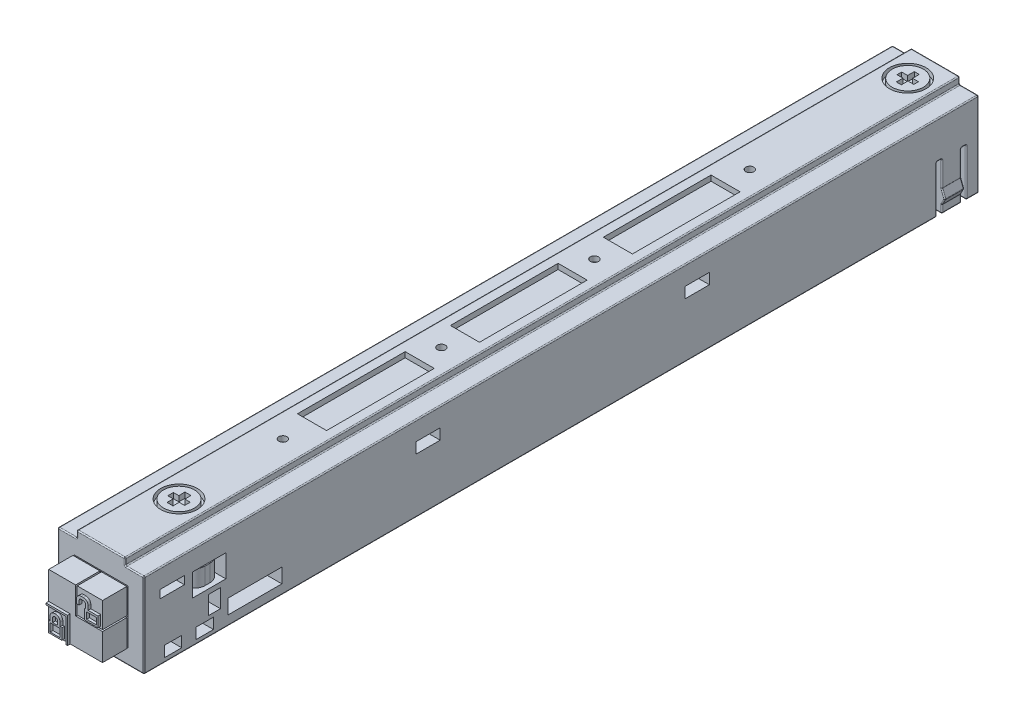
from build123d import *

# Parameters (mm, degrees)
DODANIE_WYCI_GNI_CIE2_START   = -5
DODANIE_WYCI_GNI_CIE2_DEPTH   = 155
DODANIE_WYCI_GNI_CIE3_START   = 0.2
DODANIE_WYCI_GNI_CIE3_DEPTH   = 4.5
SZKIC3_W                      = 4.698607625
SZKIC3_H                      = 4.698607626
DODANIE_WYCI_GNI_CIE3_2_DEPTH = 4.5
SZKIC4_R                      = 6.65
WYTNIJ_WYCI_GNI_CIE1_DEPTH    = 5
SZKIC5_R                      = 0.75
SZKIC5_W                      = 5.4
SZKIC5_H                      = 20
WYTNIJ_WYCI_GNI_CIE2_DEPTH    = 1
SZKIC6_R                      = 3.4
SZKIC6_R_2                    = 2.9
WYTNIJ_WYCI_GNI_CIE3_DEPTH    = 1
SZKIC7_W                      = 1.848140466
SZKIC7_H                      = 1.501618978
SZKIC7_W_2                    = 1.815055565
SZKIC7_H_2                    = 1.197562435
DODANIE_WYCI_GNI_CIE4_DEPTH   = 0.5
SZKIC8_W                      = 5.5
SZKIC8_H                      = 8.8
SZKIC8_W_2                    = 4.5
SZKIC8_H_2                    = 2
SZKIC8_W_3                    = 10
SZKIC8_H_3                    = 2.7
SZKIC8_W_4                    = 3.2
SZKIC8_W_5                    = 2.2
SZKIC8_H_4                    = 3.4
SZKIC8_W_6                    = 6.2
SZKIC8_H_5                    = 4.2
SZKIC8_H_6                    = 1.5
WYTNIJ_WYCI_GNI_CIE4_DEPTH    = 3.3
DODANIE_WYCI_GNI_CIE5_DEPTH   = 1.8
SZKIC10_W                     = 4.947492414
SZKIC10_H                     = 3.141265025
DODANIE_WYCI_GNI_CIE6_DEPTH   = 3
ZAOKR_GLENIE1_R               = 2
ZAOKR_GLENIE3_R               = 0.2
SZKIC11_W                     = 10
SZKIC11_H                     = 10
WYTNIJ_WYCI_GNI_CIE5_DEPTH    = 5


with BuildPart() as part:
    # Szkic2 → Dodanie-wyci_gni_cie2 (new body)
    with BuildSketch(Plane.XY.offset(DODANIE_WYCI_GNI_CIE2_START)):
        Polygon((4.5, 29.760650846), (4.5, 28.460650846), (8, 28.460650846), (8, 12.760650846), (-8, 12.760650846), (-8, 28.460650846), (-4.5, 28.460650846), (-4.5, 29.760650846), align=None)
    extrude(amount=-DODANIE_WYCI_GNI_CIE2_DEPTH)

    # Szkic4 → Wytnij-wyci_gni_cie1 (cut)
    with BuildSketch(Plane.XZ.offset(-12.760650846)):
        with Locations(Location((0, -82.4, 0), (0, 0, 270))):
            Circle(SZKIC4_R)
    extrude(amount=-WYTNIJ_WYCI_GNI_CIE1_DEPTH, mode=Mode.SUBTRACT)

    # Szkic5 → Wytnij-wyci_gni_cie2 (cut)
    with BuildSketch(Plane(origin=(0, 29.760650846, 0), x_dir=(1, 0, 0), z_dir=(0, 1, 0))):
        with Locations(Location((0, 125.5, 0), (0, 0, 270))):
            Circle(SZKIC5_R)
        with Locations(Location((0, 96.641559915, 0), (0, 0, 270))):
            Circle(SZKIC5_R)
        with Locations(Location((0, 68.236291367, 0), (0, 0, 270))):
            Circle(SZKIC5_R)
        with Locations(Location((0, 38.796830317, 0), (0, 0, 270))):
            Circle(SZKIC5_R)
        with Locations((0, 111)):
            Rectangle(SZKIC5_W, SZKIC5_H)
        with Locations((0, 82.6)):
            Rectangle(SZKIC5_W, SZKIC5_H)
        with Locations((0, 54.2)):
            Rectangle(SZKIC5_W, SZKIC5_H)
    extrude(amount=-WYTNIJ_WYCI_GNI_CIE2_DEPTH, mode=Mode.SUBTRACT)

    # Szkic6 → Wytnij-wyci_gni_cie3 (cut)
    # profile 1 of 4: a face of its own
    with BuildSketch(Plane(origin=(0, 29.760650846, 0), x_dir=(1, 0, 0), z_dir=(0, 1, 0))):
        with Locations(Location((0, 154.84, 0), (0, 0, 270))):
            Circle(SZKIC6_R)
        with Locations(Location((0, 154.84, 0), (0, 0, 270))):
            Circle(SZKIC6_R_2, mode=Mode.SUBTRACT)
    # profile 2 of 4: a face of its own
    with BuildSketch(Plane(origin=(0, 29.760650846, 0), x_dir=(1, 0, 0), z_dir=(0, 1, 0))):
        Polygon((-0.462089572, 154.407697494), (-1.560257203, 154.407697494), (-1.560257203, 155.272302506), (-0.462089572, 155.272302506), (-0.462089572, 156.50776406), (0.462089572, 156.50776406), (0.462089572, 155.272302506), (1.560257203, 155.272302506), (1.560257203, 154.407697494), (0.462089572, 154.407697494), (0.462089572, 153.17223594), (-0.462089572, 153.17223594), align=None)
    # profile 3 of 4: a face of its own
    with BuildSketch(Plane(origin=(0, 29.760650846, 0), x_dir=(1, 0, 0), z_dir=(0, 1, 0))):
        with Locations(Location((0, 19.5, 0), (0, 0, 270))):
            Circle(SZKIC6_R)
        with Locations(Location((0, 19.5, 0), (0, 0, 270))):
            Circle(SZKIC6_R_2, mode=Mode.SUBTRACT)
    # profile 4 of 4: a face of its own
    with BuildSketch(Plane(origin=(0, 29.760650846, 0), x_dir=(1, 0, 0), z_dir=(0, 1, 0))):
        Polygon((0.559243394, 18.978246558), (0.559243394, 17.827632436), (-0.559243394, 17.827632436), (-0.559243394, 18.978246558), (-1.560257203, 18.978246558), (-1.560257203, 20.021753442), (-0.559243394, 20.021753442), (-0.559243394, 21.172367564), (0.559243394, 21.172367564), (0.559243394, 20.021753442), (1.560257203, 20.021753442), (1.560257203, 18.978246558), align=None)
    extrude(amount=-WYTNIJ_WYCI_GNI_CIE3_DEPTH, mode=Mode.SUBTRACT)

    # Szkic8 → Wytnij-wyci_gni_cie4 (cut)
    with BuildSketch(Plane.ZY.offset(8)):
        with Locations((-154.95, 17.160650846)):
            Rectangle(SZKIC8_W, SZKIC8_H)
        with Locations((-107.75, 23.960650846)):
            Rectangle(SZKIC8_W_2, SZKIC8_H_2)
        with Locations((-57.75, 23.960650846)):
            Rectangle(SZKIC8_W_2, SZKIC8_H_2)
        with Locations((-25.6, 15.910650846)):
            Rectangle(SZKIC8_W_3, SZKIC8_H_3)
        with Locations((-16.3, 14.562529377)):
            Rectangle(SZKIC8_W_4, SZKIC8_H_2)
        with Locations((-10.4, 14.581130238)):
            Rectangle(SZKIC8_W_4, SZKIC8_H_2)
        with Locations((-18.1, 17.960650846)):
            Rectangle(SZKIC8_W_5, SZKIC8_H_4)
        with Locations((-17.1, 22.660650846)):
            Rectangle(SZKIC8_W_6, SZKIC8_H_5)
        with Locations((-10.25, 24.210650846)):
            Rectangle(SZKIC8_W_2, SZKIC8_H_6)
    wytnij_wyci_gni_cie4 = extrude(amount=-WYTNIJ_WYCI_GNI_CIE4_DEPTH, mode=Mode.SUBTRACT)

    # Szkic9 → Dodanie-wyci_gni_cie5 (add, symmetric)
    with BuildSketch(Plane.XY.offset(-154.95)):
        Polygon((-8, 21.560650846), (-8, 16.873874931), (-8.597066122, 15.349898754), (-8, 14.243201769), (-8, 12.77675068), (-6.27481671, 12.77675068), (-6.27481671, 14.243201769), (-6.27481671, 21.560650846), align=None)
    dodanie_wyci_gni_cie5 = extrude(amount=DODANIE_WYCI_GNI_CIE5_DEPTH, both=True)

    # Lustro3: Wytnij-wyci_gni_cie4, Dodanie-wyci_gni_cie5 across plane
    add(wytnij_wyci_gni_cie4.mirror(Plane(origin=(0, 0, 0), x_dir=(0, 0, 1), z_dir=(1, 0, 0))), mode=Mode.SUBTRACT)
    add(dodanie_wyci_gni_cie5.mirror(Plane(origin=(0, 0, 0), x_dir=(0, 0, 1), z_dir=(1, 0, 0))))

    # Zaokr_glenie3
    zaokr_glenie3_edges = [part.edges().sort_by_distance(p)[0] for p in [
        (0, 29.760650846, -5),
        (4.5, 29.110650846, -5),
        (6.25, 28.460650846, -5),
        (8, 20.610650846, -5),
        (4.5, 29.110650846, -160),
        (8, 12.760650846, -158.85),
        (-8, 12.760650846, -158.85),
        (-8, 28.460650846, -82.5),
        (-4.5, 28.460650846, -82.5),
        (-4.5, 29.760650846, -82.5),
        (4.5, 29.760650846, -82.5),
        (4.5, 28.460650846, -82.5),
        (8, 28.460650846, -82.5),
        (0, 29.760650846, -160),
        (-8, 12.760650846, -78.6),
        (-4.7, 17.160650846, -157.7),
        (-6.35, 12.760650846, -157.7),
        (-4.7, 21.560650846, -154.95),
        (-6.35, 21.560650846, -157.7),
        (-4.7, 17.160650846, -152.2),
        (-6.35, 21.560650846, -152.2),
        (-4.7, 12.760650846, -154.95),
        (-6.35, 12.760650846, -152.2),
        (-8, 17.160650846, -157.7),
        (-8, 17.160650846, -152.2),
        (-8, 21.560650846, -152.675),
        (-4.5, 29.110650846, -160),
        (-6.25, 28.460650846, -160),
        (-8, 20.610650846, -160),
        (-8, 21.560650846, -157.225),
        (-8, 14.243201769, -154.95),
        (-8.298533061, 14.796550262, -156.75),
        (-8.597066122, 15.349898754, -154.95),
        (-8.298533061, 16.111886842, -156.75),
        (-8, 16.873874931, -154.95),
        (-8, 19.217262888, -156.75),
        (-7.137408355, 21.560650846, -156.75),
        (-6.27481671, 21.560650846, -154.95),
        (-6.27481671, 17.168700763, -156.75),
        (-6.27481671, 12.77675068, -154.95),
        (-7.137408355, 12.77675068, -156.75),
        (-8, 12.77675068, -154.95),
        (-8, 13.509976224, -156.75),
        (-8.298533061, 14.796550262, -153.15),
        (-8, 13.509976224, -153.15),
        (-7.137408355, 12.77675068, -153.15),
        (-6.27481671, 17.168700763, -153.15),
        (-7.137408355, 21.560650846, -153.15),
        (-8, 19.217262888, -153.15),
        (-8.298533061, 16.111886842, -153.15),
        (0, 12.760650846, -160),
        (8, 12.760650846, -78.6),
        (8, 17.160650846, -157.7),
        (6.35, 21.560650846, -157.7),
        (6.35, 12.760650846, -157.7),
        (8, 17.160650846, -152.2),
        (6.35, 12.760650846, -152.2),
        (8, 21.560650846, -152.675),
        (6.35, 21.560650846, -152.2),
        (4.7, 17.160650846, -157.7),
        (4.7, 12.760650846, -154.95),
        (4.7, 17.160650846, -152.2),
        (4.7, 21.560650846, -154.95),
        (8, 21.560650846, -157.225),
        (8.597066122, 15.349898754, -154.95),
        (8.298533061, 14.796550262, -153.15),
        (8, 14.243201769, -154.95),
        (8, 13.509976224, -153.15),
        (8, 12.77675068, -154.95),
        (7.137408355, 12.77675068, -153.15),
        (6.27481671, 12.77675068, -154.95),
        (6.27481671, 17.168700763, -153.15),
        (6.27481671, 21.560650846, -154.95),
        (7.137408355, 21.560650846, -153.15),
        (8, 19.217262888, -153.15),
        (8, 16.873874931, -154.95),
        (8.298533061, 16.111886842, -153.15),
        (8.298533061, 14.796550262, -156.75),
        (8, 13.509976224, -156.75),
        (7.137408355, 12.77675068, -156.75),
        (6.27481671, 17.168700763, -156.75),
        (7.137408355, 21.560650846, -156.75),
        (8, 19.217262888, -156.75),
        (8.298533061, 16.111886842, -156.75),
        (8, 20.610650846, -160),
        (0, 12.760650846, -5),
        (6.25, 28.460650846, -160),
        (-8, 20.610650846, -5),
        (-6.25, 28.460650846, -5),
        (-4.5, 29.110650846, -5),
    ]]
    fillet(zaokr_glenie3_edges, radius=ZAOKR_GLENIE3_R)

    # Szkic11 → Wytnij-wyci_gni_cie5 (cut)
    with BuildSketch(Plane.XY.offset(-5)):
        with Locations((0, 20.535408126)):
            Rectangle(SZKIC11_W, SZKIC11_H)
    extrude(amount=-WYTNIJ_WYCI_GNI_CIE5_DEPTH, mode=Mode.SUBTRACT)


with BuildPart() as body_2:
    # Szkic3 → Dodanie-wyci_gni_cie3 (new body)
    with BuildSketch(Plane.XY.offset(-5).offset(DODANIE_WYCI_GNI_CIE3_START)):
        Polygon((0, 25.535408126), (0, 20.535408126), (5, 20.535408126), (5, 15.535408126), (-5, 15.535408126), (-5, 25.535408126), align=None)
    extrude(amount=DODANIE_WYCI_GNI_CIE3_DEPTH)



with BuildPart() as body_3:
    # Szkic3 → Dodanie-wyci_gni_cie3 2 (new body)
    with BuildSketch(Plane.XY.offset(-5).offset(DODANIE_WYCI_GNI_CIE3_START)):
        with Locations((2.650696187, 23.186104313)):
            Rectangle(SZKIC3_W, SZKIC3_H)
    extrude(amount=DODANIE_WYCI_GNI_CIE3_2_DEPTH)


with BuildPart() as body_2_1:
    add(body_2.part)

    add(body_3.part)  # Dodanie-wyci_gni_cie4 merges body 3
    # Szkic7 → Dodanie-wyci_gni_cie4 (add)
    # profile 1 of 3: a face of its own
    with BuildSketch(Plane.XY.offset(-0.3)):
        with BuildLine():
            Line((-4.544070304, 17.849639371), (-4.273388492, 17.849639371))
            Line((-4.273388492, 17.849639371), (-4.273388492, 18.602038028))
            ThreePointArc((-4.273388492, 18.602038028), (-4.009784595, 19.238434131), (-3.373388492, 19.502038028))
            Line((-3.373388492, 19.502038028), (-3.283643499, 19.502038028))
            ThreePointArc((-3.283643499, 19.502038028), (-2.647247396, 19.238434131), (-2.383643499, 18.602038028))
            Line((-2.383643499, 18.602038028), (-2.383643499, 17.849639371))
            Line((-2.383643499, 17.849639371), (-2.07135716, 17.849639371))
            Line((-2.07135716, 17.849639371), (-2.07135716, 15.840553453))
            Line((-2.07135716, 15.840553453), (-4.544070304, 15.840553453))
            Line((-4.544070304, 15.840553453), (-4.544070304, 17.849639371))
        make_face()
        with BuildLine():
            Line((-3.773388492, 17.849639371), (-3.773388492, 18.602038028))
            ThreePointArc((-3.773388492, 18.602038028), (-3.656231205, 18.884880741), (-3.373388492, 19.002038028))
            Line((-3.373388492, 19.002038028), (-3.283643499, 19.002038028))
            ThreePointArc((-3.283643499, 19.002038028), (-3.000800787, 18.884880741), (-2.883643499, 18.602038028))
            Line((-2.883643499, 18.602038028), (-2.883643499, 17.849639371))
            Line((-2.883643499, 17.849639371), (-3.773388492, 17.849639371))
        make_face(mode=Mode.SUBTRACT)
        with Locations((-3.307713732, 16.845096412)):
            Rectangle(SZKIC7_W, SZKIC7_H, mode=Mode.SUBTRACT)
    # profile 2 of 3: a face of its own
    with BuildSketch(Plane.XY.offset(-0.3)):
        Polygon((-5, 20.071138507), (-1.286347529, 20.071138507), (-1.286347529, 15.535408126), (-0.998170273, 15.535408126), (-0.998170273, 20.385513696), (-5, 20.385513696), align=None)
    # profile 3 of 3: a face of its own
    with BuildSketch(Plane.XY.offset(-0.3)):
        with BuildLine():
            Line((2.324541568, 23.107968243), (2.324541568, 23.830650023))
            ThreePointArc((2.324541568, 23.830650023), (2.20738428, 24.113492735), (1.924541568, 24.230650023))
            Line((1.924541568, 24.230650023), (1.541898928, 24.230650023))
            ThreePointArc((1.541898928, 24.230650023), (1.259056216, 24.113492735), (1.141898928, 23.830650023))
            Line((1.141898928, 23.830650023), (1.141898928, 23.107968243))
            Line((1.141898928, 23.107968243), (0.641898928, 23.107968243))
            Line((0.641898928, 23.107968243), (0.641898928, 23.830650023))
            ThreePointArc((0.641898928, 23.830650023), (0.905502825, 24.467046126), (1.541898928, 24.730650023))
            Line((1.541898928, 24.730650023), (1.924541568, 24.730650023))
            ThreePointArc((1.924541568, 24.730650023), (2.560937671, 24.467046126), (2.824541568, 23.830650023))
            Line((2.824541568, 23.830650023), (2.824541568, 23.107968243))
            Line((2.824541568, 23.107968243), (4.658547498, 23.107968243))
            Line((4.658547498, 23.107968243), (4.658547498, 21.218065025))
            Line((4.658547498, 21.218065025), (2.188574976, 21.218065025))
            Line((2.188574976, 21.218065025), (2.188574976, 23.107968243))
            Line((2.188574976, 23.107968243), (2.324541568, 23.107968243))
        make_face()
        with Locations((3.451629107, 22.134948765)):
            Rectangle(SZKIC7_W_2, SZKIC7_H_2, mode=Mode.SUBTRACT)
    extrude(amount=DODANIE_WYCI_GNI_CIE4_DEPTH)


with BuildPart() as body_3_2:
    # Szkic10 → Dodanie-wyci_gni_cie6 (new body)
    with BuildSketch(Plane.ZY.offset(4.7)):
        with Locations((-17.090964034, 22.678340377)):
            Rectangle(SZKIC10_W, SZKIC10_H)
    extrude(amount=DODANIE_WYCI_GNI_CIE6_DEPTH)

    # Zaokr_glenie1
    zaokr_glenie1_edges = [body_3_2.edges().sort_by_distance(p)[0] for p in [
        (-7.7, 22.678340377, -14.617217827),
        (-7.7, 22.678340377, -19.564710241),
    ]]
    fillet(zaokr_glenie1_edges, radius=ZAOKR_GLENIE1_R)


with BuildPart() as body_4:
    # Lustro4: mirrored copy
    add(body_3_2.part.mirror(Plane(origin=(0, 0, 0), x_dir=(0, 0, 1), z_dir=(1, 0, 0))))


solid = Compound([part.part, body_2_1.part, body_3_2.part, body_4.part])
